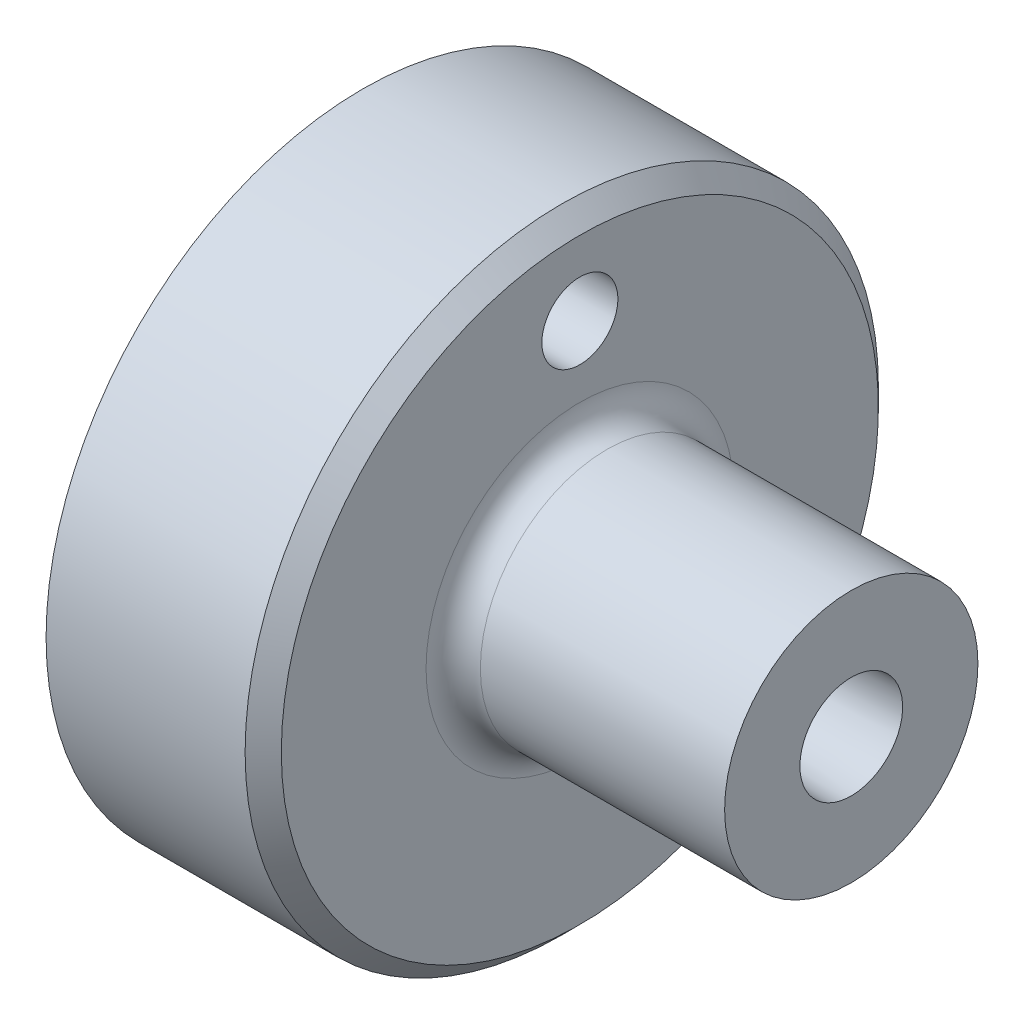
ISO-10303-21;
HEADER;
FILE_DESCRIPTION(('STEP AP214'),'2;1');
FILE_NAME('part.step','',(''),(''),'','','');
FILE_SCHEMA(('AUTOMOTIVE_DESIGN { 1 0 10303 214 1 1 1 1 }'));
ENDSEC;
DATA;
#1=APPLICATION_CONTEXT('core data for automotive mechanical design processes');
#2=APPLICATION_PROTOCOL_DEFINITION('international standard','automotive_design',2000,#1);
#3=PRODUCT_CONTEXT('',#1,'mechanical');
#4=PRODUCT('Part','Part','',(#3));
#5=PRODUCT_RELATED_PRODUCT_CATEGORY('part','',(#4));
#6=PRODUCT_DEFINITION_FORMATION('','',#4);
#7=PRODUCT_DEFINITION_CONTEXT('part definition',#1,'design');
#8=PRODUCT_DEFINITION('design','',#6,#7);
#9=PRODUCT_DEFINITION_SHAPE('','',#8);
#10=(LENGTH_UNIT() NAMED_UNIT(*) SI_UNIT(.MILLI.,.METRE.));
#11=(NAMED_UNIT(*) PLANE_ANGLE_UNIT() SI_UNIT($,.RADIAN.));
#12=(NAMED_UNIT(*) SI_UNIT($,.STERADIAN.) SOLID_ANGLE_UNIT());
#13=UNCERTAINTY_MEASURE_WITH_UNIT(LENGTH_MEASURE(1.E-05),#10,'distance_accuracy_value','');
#14=(GEOMETRIC_REPRESENTATION_CONTEXT(3) GLOBAL_UNCERTAINTY_ASSIGNED_CONTEXT((#13)) GLOBAL_UNIT_ASSIGNED_CONTEXT((#10,
#11,#12)) REPRESENTATION_CONTEXT('',''));
#15=CARTESIAN_POINT('',(0.,0.,0.));
#16=DIRECTION('',(0.,0.,1.));
#17=DIRECTION('',(1.,0.,0.));
#18=AXIS2_PLACEMENT_3D('',#15,#16,#17);
#19=CARTESIAN_POINT('',(13.5,0.,0.));
#20=DIRECTION('',(-1.,0.,0.));
#21=DIRECTION('',(0.,0.,1.));
#22=AXIS2_PLACEMENT_3D('',#19,#20,#21);
#23=TOROIDAL_SURFACE('',#22,8.5,1.5);
#24=CARTESIAN_POINT('',(12.,0.,0.));
#25=DIRECTION('',(-1.,0.,0.));
#26=DIRECTION('',(0.,0.,1.));
#27=AXIS2_PLACEMENT_3D('',#24,#25,#26);
#28=CIRCLE('',#27,8.5);
#29=CARTESIAN_POINT('',(12.,0.,8.5));
#30=VERTEX_POINT('',#29);
#31=EDGE_CURVE('E29',#30,#30,#28,.T.);
#32=ORIENTED_EDGE('',*,*,#31,.F.);
#33=EDGE_LOOP('',(#32));
#34=FACE_BOUND('',#33,.T.);
#35=CARTESIAN_POINT('',(13.5,0.,0.));
#36=DIRECTION('',(-1.,0.,0.));
#37=DIRECTION('',(0.,0.,1.));
#38=AXIS2_PLACEMENT_3D('',#35,#36,#37);
#39=CIRCLE('',#38,7.);
#40=CARTESIAN_POINT('',(13.5,0.,7.));
#41=VERTEX_POINT('',#40);
#42=EDGE_CURVE('E63',#41,#41,#39,.T.);
#43=ORIENTED_EDGE('',*,*,#42,.T.);
#44=EDGE_LOOP('',(#43));
#45=FACE_BOUND('',#44,.T.);
#46=ADVANCED_FACE('F13',(#34,#45),#23,.F.);
#47=CARTESIAN_POINT('',(12.,17.5,0.));
#48=DIRECTION('',(-1.,0.,0.));
#49=DIRECTION('',(0.,0.,1.));
#50=AXIS2_PLACEMENT_3D('',#47,#48,#49);
#51=PLANE('',#50);
#52=CARTESIAN_POINT('',(12.,0.,0.));
#53=DIRECTION('',(-1.,0.,0.));
#54=DIRECTION('',(0.,0.,1.));
#55=AXIS2_PLACEMENT_3D('',#52,#53,#54);
#56=CIRCLE('',#55,16.5);
#57=CARTESIAN_POINT('',(12.,0.,16.5));
#58=VERTEX_POINT('',#57);
#59=EDGE_CURVE('E8',#58,#58,#56,.F.);
#60=ORIENTED_EDGE('',*,*,#59,.T.);
#61=EDGE_LOOP('',(#60));
#62=FACE_BOUND('',#61,.T.);
#63=CARTESIAN_POINT('',(12.,12.4,0.));
#64=DIRECTION('',(-1.,0.,0.));
#65=DIRECTION('',(0.,0.,1.));
#66=AXIS2_PLACEMENT_3D('',#63,#64,#65);
#67=CIRCLE('',#66,2.1);
#68=CARTESIAN_POINT('',(12.,12.4,2.1));
#69=VERTEX_POINT('',#68);
#70=EDGE_CURVE('E39',#69,#69,#67,.T.);
#71=ORIENTED_EDGE('',*,*,#70,.T.);
#72=EDGE_LOOP('',(#71));
#73=FACE_BOUND('',#72,.T.);
#74=ORIENTED_EDGE('',*,*,#31,.T.);
#75=EDGE_LOOP('',(#74));
#76=FACE_BOUND('',#75,.T.);
#77=ADVANCED_FACE('F102',(#62,#73,#76),#51,.F.);
#78=CARTESIAN_POINT('',(0.,0.,0.));
#79=DIRECTION('',(-1.,0.,0.));
#80=DIRECTION('',(0.,0.,1.));
#81=AXIS2_PLACEMENT_3D('',#78,#79,#80);
#82=CYLINDRICAL_SURFACE('',#81,17.5);
#83=CARTESIAN_POINT('',(11.,0.,0.));
#84=DIRECTION('',(-1.,0.,0.));
#85=DIRECTION('',(0.,0.,1.));
#86=AXIS2_PLACEMENT_3D('',#83,#84,#85);
#87=CIRCLE('',#86,17.5);
#88=CARTESIAN_POINT('',(11.,0.,17.5));
#89=VERTEX_POINT('',#88);
#90=EDGE_CURVE('E21',#89,#89,#87,.T.);
#91=ORIENTED_EDGE('',*,*,#90,.T.);
#92=EDGE_LOOP('',(#91));
#93=FACE_BOUND('',#92,.T.);
#94=CARTESIAN_POINT('',(0.,0.,0.));
#95=DIRECTION('',(-1.,0.,0.));
#96=DIRECTION('',(0.,0.,1.));
#97=AXIS2_PLACEMENT_3D('',#94,#95,#96);
#98=CIRCLE('',#97,17.5);
#99=CARTESIAN_POINT('',(0.,0.,17.5));
#100=VERTEX_POINT('',#99);
#101=EDGE_CURVE('E36',#100,#100,#98,.T.);
#102=ORIENTED_EDGE('',*,*,#101,.F.);
#103=EDGE_LOOP('',(#102));
#104=FACE_BOUND('',#103,.T.);
#105=ADVANCED_FACE('F95',(#93,#104),#82,.T.);
#106=CARTESIAN_POINT('',(0.,4.10062261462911,0.));
#107=DIRECTION('',(1.,0.,0.));
#108=DIRECTION('',(0.,0.,-1.));
#109=AXIS2_PLACEMENT_3D('',#106,#107,#108);
#110=PLANE('',#109);
#111=CARTESIAN_POINT('',(0.,12.4,0.));
#112=DIRECTION('',(-1.,0.,0.));
#113=DIRECTION('',(0.,0.,1.));
#114=AXIS2_PLACEMENT_3D('',#111,#112,#113);
#115=CIRCLE('',#114,3.6);
#116=CARTESIAN_POINT('',(0.,12.4,3.6));
#117=VERTEX_POINT('',#116);
#118=EDGE_CURVE('E41',#117,#117,#115,.T.);
#119=ORIENTED_EDGE('',*,*,#118,.F.);
#120=EDGE_LOOP('',(#119));
#121=FACE_BOUND('',#120,.T.);
#122=CARTESIAN_POINT('',(0.,0.,0.));
#123=DIRECTION('',(-1.,0.,0.));
#124=DIRECTION('',(0.,0.,1.));
#125=AXIS2_PLACEMENT_3D('',#122,#123,#124);
#126=CIRCLE('',#125,4.10062261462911);
#127=CARTESIAN_POINT('',(0.,0.,4.10062261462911));
#128=VERTEX_POINT('',#127);
#129=EDGE_CURVE('E47',#128,#128,#126,.T.);
#130=ORIENTED_EDGE('',*,*,#129,.F.);
#131=EDGE_LOOP('',(#130));
#132=FACE_BOUND('',#131,.T.);
#133=ORIENTED_EDGE('',*,*,#101,.T.);
#134=EDGE_LOOP('',(#133));
#135=FACE_BOUND('',#134,.T.);
#136=ADVANCED_FACE('F91',(#121,#132,#135),#110,.F.);
#137=CARTESIAN_POINT('',(0.,0.,0.));
#138=DIRECTION('',(-1.,0.,0.));
#139=DIRECTION('',(0.,0.,1.));
#140=AXIS2_PLACEMENT_3D('',#137,#138,#139);
#141=CONICAL_SURFACE('',#140,4.10062261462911,0.610865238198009);
#142=CARTESIAN_POINT('',(3.,0.,0.));
#143=DIRECTION('',(-1.,0.,0.));
#144=DIRECTION('',(0.,0.,1.));
#145=AXIS2_PLACEMENT_3D('',#142,#143,#144);
#146=CIRCLE('',#145,2.);
#147=CARTESIAN_POINT('',(3.,0.,2.));
#148=VERTEX_POINT('',#147);
#149=EDGE_CURVE('E51',#148,#148,#146,.T.);
#150=ORIENTED_EDGE('',*,*,#149,.F.);
#151=EDGE_LOOP('',(#150));
#152=FACE_BOUND('',#151,.T.);
#153=ORIENTED_EDGE('',*,*,#129,.T.);
#154=EDGE_LOOP('',(#153));
#155=FACE_BOUND('',#154,.T.);
#156=ADVANCED_FACE('F94',(#152,#155),#141,.F.);
#157=CARTESIAN_POINT('',(3.,0.,0.));
#158=DIRECTION('',(1.,0.,0.));
#159=DIRECTION('',(0.,0.,-1.));
#160=AXIS2_PLACEMENT_3D('',#157,#158,#159);
#161=CONICAL_SURFACE('',#160,2.,0.0349065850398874);
#162=CARTESIAN_POINT('',(27.,0.,0.));
#163=DIRECTION('',(-1.,0.,0.));
#164=DIRECTION('',(0.,0.,1.));
#165=AXIS2_PLACEMENT_3D('',#162,#163,#164);
#166=CIRCLE('',#165,2.83809846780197);
#167=CARTESIAN_POINT('',(27.,0.,2.83809846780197));
#168=VERTEX_POINT('',#167);
#169=EDGE_CURVE('E55',#168,#168,#166,.T.);
#170=ORIENTED_EDGE('',*,*,#169,.F.);
#171=EDGE_LOOP('',(#170));
#172=FACE_BOUND('',#171,.T.);
#173=ORIENTED_EDGE('',*,*,#149,.T.);
#174=EDGE_LOOP('',(#173));
#175=FACE_BOUND('',#174,.T.);
#176=ADVANCED_FACE('F123',(#172,#175),#161,.F.);
#177=CARTESIAN_POINT('',(27.,7.,0.));
#178=DIRECTION('',(-1.,0.,0.));
#179=DIRECTION('',(0.,0.,1.));
#180=AXIS2_PLACEMENT_3D('',#177,#178,#179);
#181=PLANE('',#180);
#182=CARTESIAN_POINT('',(27.,0.,0.));
#183=DIRECTION('',(-1.,0.,0.));
#184=DIRECTION('',(0.,0.,1.));
#185=AXIS2_PLACEMENT_3D('',#182,#183,#184);
#186=CIRCLE('',#185,7.);
#187=CARTESIAN_POINT('',(27.,0.,7.));
#188=VERTEX_POINT('',#187);
#189=EDGE_CURVE('E59',#188,#188,#186,.T.);
#190=ORIENTED_EDGE('',*,*,#189,.F.);
#191=EDGE_LOOP('',(#190));
#192=FACE_BOUND('',#191,.T.);
#193=ORIENTED_EDGE('',*,*,#169,.T.);
#194=EDGE_LOOP('',(#193));
#195=FACE_BOUND('',#194,.T.);
#196=ADVANCED_FACE('F117',(#192,#195),#181,.F.);
#197=CARTESIAN_POINT('',(0.,0.,0.));
#198=DIRECTION('',(-1.,0.,0.));
#199=DIRECTION('',(0.,0.,1.));
#200=AXIS2_PLACEMENT_3D('',#197,#198,#199);
#201=CYLINDRICAL_SURFACE('',#200,7.);
#202=ORIENTED_EDGE('',*,*,#42,.F.);
#203=EDGE_LOOP('',(#202));
#204=FACE_BOUND('',#203,.T.);
#205=ORIENTED_EDGE('',*,*,#189,.T.);
#206=EDGE_LOOP('',(#205));
#207=FACE_BOUND('',#206,.T.);
#208=ADVANCED_FACE('F87',(#204,#207),#201,.T.);
#209=CARTESIAN_POINT('',(5.,12.4,0.));
#210=DIRECTION('',(-1.,0.,0.));
#211=DIRECTION('',(0.,0.,1.));
#212=AXIS2_PLACEMENT_3D('',#209,#210,#211);
#213=CYLINDRICAL_SURFACE('',#212,3.6);
#214=CARTESIAN_POINT('',(5.,12.4,0.));
#215=DIRECTION('',(-1.,0.,0.));
#216=DIRECTION('',(0.,0.,1.));
#217=AXIS2_PLACEMENT_3D('',#214,#215,#216);
#218=CIRCLE('',#217,3.6);
#219=CARTESIAN_POINT('',(5.,12.4,3.6));
#220=VERTEX_POINT('',#219);
#221=EDGE_CURVE('E66',#220,#220,#218,.T.);
#222=ORIENTED_EDGE('',*,*,#221,.F.);
#223=EDGE_LOOP('',(#222));
#224=FACE_BOUND('',#223,.T.);
#225=ORIENTED_EDGE('',*,*,#118,.T.);
#226=EDGE_LOOP('',(#225));
#227=FACE_BOUND('',#226,.T.);
#228=ADVANCED_FACE('F81',(#224,#227),#213,.F.);
#229=CARTESIAN_POINT('',(5.,12.4,0.));
#230=DIRECTION('',(-1.,0.,0.));
#231=DIRECTION('',(0.,0.,1.));
#232=AXIS2_PLACEMENT_3D('',#229,#230,#231);
#233=PLANE('',#232);
#234=CARTESIAN_POINT('',(5.,12.4,0.));
#235=DIRECTION('',(-1.,0.,0.));
#236=DIRECTION('',(0.,0.,1.));
#237=AXIS2_PLACEMENT_3D('',#234,#235,#236);
#238=CIRCLE('',#237,2.1);
#239=CARTESIAN_POINT('',(5.,12.4,2.1));
#240=VERTEX_POINT('',#239);
#241=EDGE_CURVE('E42',#240,#240,#238,.T.);
#242=ORIENTED_EDGE('',*,*,#241,.F.);
#243=EDGE_LOOP('',(#242));
#244=FACE_BOUND('',#243,.T.);
#245=ORIENTED_EDGE('',*,*,#221,.T.);
#246=EDGE_LOOP('',(#245));
#247=FACE_BOUND('',#246,.T.);
#248=ADVANCED_FACE('F78',(#244,#247),#233,.T.);
#249=CARTESIAN_POINT('',(27.,12.4,0.));
#250=DIRECTION('',(-1.,0.,0.));
#251=DIRECTION('',(0.,0.,1.));
#252=AXIS2_PLACEMENT_3D('',#249,#250,#251);
#253=CYLINDRICAL_SURFACE('',#252,2.1);
#254=ORIENTED_EDGE('',*,*,#241,.T.);
#255=EDGE_LOOP('',(#254));
#256=FACE_BOUND('',#255,.T.);
#257=ORIENTED_EDGE('',*,*,#70,.F.);
#258=EDGE_LOOP('',(#257));
#259=FACE_BOUND('',#258,.T.);
#260=ADVANCED_FACE('F75',(#256,#259),#253,.F.);
#261=CARTESIAN_POINT('',(11.,0.,0.));
#262=DIRECTION('',(-1.,0.,0.));
#263=DIRECTION('',(0.,0.,1.));
#264=AXIS2_PLACEMENT_3D('',#261,#262,#263);
#265=CONICAL_SURFACE('',#264,17.5,0.78539816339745);
#266=ORIENTED_EDGE('',*,*,#59,.F.);
#267=EDGE_LOOP('',(#266));
#268=FACE_BOUND('',#267,.T.);
#269=ORIENTED_EDGE('',*,*,#90,.F.);
#270=EDGE_LOOP('',(#269));
#271=FACE_BOUND('',#270,.T.);
#272=ADVANCED_FACE('F15',(#268,#271),#265,.T.);
#273=CLOSED_SHELL('',(#46,#77,#105,#136,#156,#176,#196,#208,#228,#248,#260,#272));
#274=MANIFOLD_SOLID_BREP('B1',#273);
#275=ADVANCED_BREP_SHAPE_REPRESENTATION('',(#18,#274),#14);
#276=SHAPE_DEFINITION_REPRESENTATION(#9,#275);
ENDSEC;
END-ISO-10303-21;
